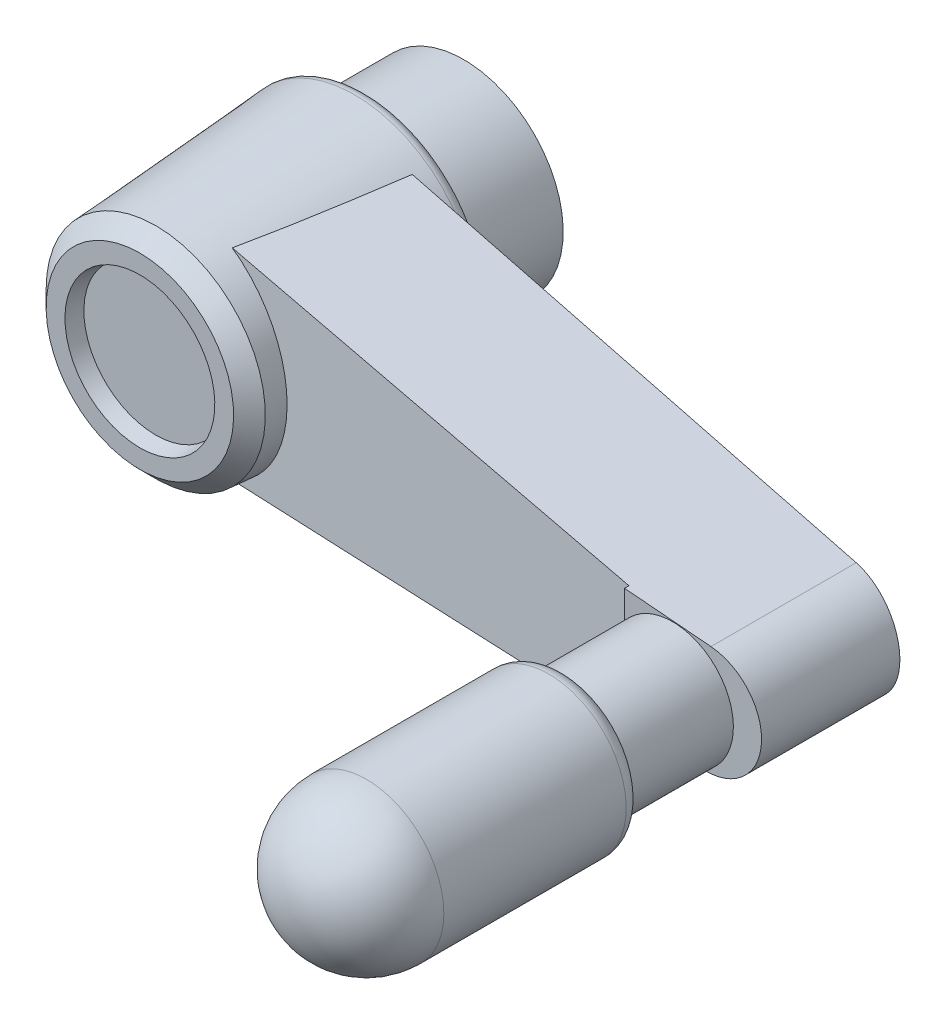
ISO-10303-21;
HEADER;
FILE_DESCRIPTION(('STEP AP214'),'2;1');
FILE_NAME('part.step','',(''),(''),'','','');
FILE_SCHEMA(('AUTOMOTIVE_DESIGN { 1 0 10303 214 1 1 1 1 }'));
ENDSEC;
DATA;
#1=APPLICATION_CONTEXT('core data for automotive mechanical design processes');
#2=APPLICATION_PROTOCOL_DEFINITION('international standard','automotive_design',2000,#1);
#3=PRODUCT_CONTEXT('',#1,'mechanical');
#4=PRODUCT('Part','Part','',(#3));
#5=PRODUCT_RELATED_PRODUCT_CATEGORY('part','',(#4));
#6=PRODUCT_DEFINITION_FORMATION('','',#4);
#7=PRODUCT_DEFINITION_CONTEXT('part definition',#1,'design');
#8=PRODUCT_DEFINITION('design','',#6,#7);
#9=PRODUCT_DEFINITION_SHAPE('','',#8);
#10=(LENGTH_UNIT() NAMED_UNIT(*) SI_UNIT(.MILLI.,.METRE.));
#11=(NAMED_UNIT(*) PLANE_ANGLE_UNIT() SI_UNIT($,.RADIAN.));
#12=(NAMED_UNIT(*) SI_UNIT($,.STERADIAN.) SOLID_ANGLE_UNIT());
#13=UNCERTAINTY_MEASURE_WITH_UNIT(LENGTH_MEASURE(1.E-05),#10,'distance_accuracy_value','');
#14=(GEOMETRIC_REPRESENTATION_CONTEXT(3) GLOBAL_UNCERTAINTY_ASSIGNED_CONTEXT((#13)) GLOBAL_UNIT_ASSIGNED_CONTEXT((#10,
#11,#12)) REPRESENTATION_CONTEXT('',''));
#15=CARTESIAN_POINT('',(0.,0.,0.));
#16=DIRECTION('',(0.,0.,1.));
#17=DIRECTION('',(1.,0.,0.));
#18=AXIS2_PLACEMENT_3D('',#15,#16,#17);
#19=CARTESIAN_POINT('',(45.35,-20.5,31.));
#20=DIRECTION('',(0.,0.,-1.));
#21=DIRECTION('',(0.,1.,0.));
#22=AXIS2_PLACEMENT_3D('',#19,#20,#21);
#23=PLANE('',#22);
#24=CARTESIAN_POINT('',(50.,0.,31.));
#25=DIRECTION('',(0.,0.,-1.));
#26=DIRECTION('',(0.,1.,0.));
#27=AXIS2_PLACEMENT_3D('',#24,#25,#26);
#28=CIRCLE('',#27,4.125);
#29=CARTESIAN_POINT('',(50.,4.125,31.));
#30=VERTEX_POINT('',#29);
#31=EDGE_CURVE('E371',#30,#30,#28,.T.);
#32=ORIENTED_EDGE('',*,*,#31,.T.);
#33=EDGE_LOOP('',(#32));
#34=FACE_BOUND('',#33,.T.);
#35=CARTESIAN_POINT('',(52.75,0.,31.));
#36=DIRECTION('',(0.,0.,1.));
#37=DIRECTION('',(0.,-1.,0.));
#38=AXIS2_PLACEMENT_3D('',#35,#36,#37);
#39=CIRCLE('',#38,5.);
#40=CARTESIAN_POINT('',(53.1699052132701,4.98233676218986,31.));
#41=VERTEX_POINT('',#40);
#42=CARTESIAN_POINT('',(53.1699052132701,-4.98233676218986,31.));
#43=VERTEX_POINT('',#42);
#44=EDGE_CURVE('E472',#41,#43,#39,.F.);
#45=ORIENTED_EDGE('',*,*,#44,.F.);
#46=DIRECTION('',(0.996467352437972,-0.0839810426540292,0.));
#47=VECTOR('',#46,1.);
#48=CARTESIAN_POINT('',(45.35,5.64138875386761,31.));
#49=LINE('',#48,#47);
#50=CARTESIAN_POINT('',(45.35,5.64138875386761,31.));
#51=VERTEX_POINT('',#50);
#52=EDGE_CURVE('E474',#51,#41,#49,.T.);
#53=ORIENTED_EDGE('',*,*,#52,.F.);
#54=DIRECTION('',(0.,1.,0.));
#55=VECTOR('',#54,1.);
#56=CARTESIAN_POINT('',(45.35,-20.5,31.));
#57=LINE('',#56,#55);
#58=CARTESIAN_POINT('',(45.35,-5.64138875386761,31.));
#59=VERTEX_POINT('',#58);
#60=EDGE_CURVE('E471',#59,#51,#57,.T.);
#61=ORIENTED_EDGE('',*,*,#60,.F.);
#62=DIRECTION('',(0.996467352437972,0.0839810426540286,0.));
#63=VECTOR('',#62,1.);
#64=CARTESIAN_POINT('',(0.791941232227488,-9.39668713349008,31.));
#65=LINE('',#64,#63);
#66=EDGE_CURVE('E489',#43,#59,#65,.F.);
#67=ORIENTED_EDGE('',*,*,#66,.F.);
#68=EDGE_LOOP('',(#45,#53,#61,#67));
#69=FACE_BOUND('',#68,.T.);
#70=ADVANCED_FACE('F15',(#34,#69),#23,.F.);
#71=CARTESIAN_POINT('',(52.75,0.,50.));
#72=DIRECTION('',(0.,0.,1.));
#73=DIRECTION('',(0.,-1.,0.));
#74=AXIS2_PLACEMENT_3D('',#71,#72,#73);
#75=CYLINDRICAL_SURFACE('',#74,5.);
#76=CARTESIAN_POINT('',(52.75,0.,17.7978260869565));
#77=DIRECTION('',(-0.136394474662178,0.,0.990654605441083));
#78=DIRECTION('',(0.990654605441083,0.,0.136394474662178));
#79=AXIS2_PLACEMENT_3D('',#76,#77,#78);
#80=ELLIPSE('',#79,5.04716777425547,5.);
#81=CARTESIAN_POINT('',(53.1699052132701,-4.98233676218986,17.8556391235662));
#82=VERTEX_POINT('',#81);
#83=CARTESIAN_POINT('',(53.1699052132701,4.98233676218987,17.8556391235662));
#84=VERTEX_POINT('',#83);
#85=EDGE_CURVE('E455',#82,#84,#80,.T.);
#86=ORIENTED_EDGE('',*,*,#85,.T.);
#87=DIRECTION('',(0.,0.,1.));
#88=VECTOR('',#87,1.);
#89=CARTESIAN_POINT('',(53.1699052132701,4.98233676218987,50.));
#90=LINE('',#89,#88);
#91=EDGE_CURVE('E457',#84,#41,#90,.T.);
#92=ORIENTED_EDGE('',*,*,#91,.T.);
#93=ORIENTED_EDGE('',*,*,#44,.T.);
#94=DIRECTION('',(0.,0.,1.));
#95=VECTOR('',#94,1.);
#96=CARTESIAN_POINT('',(53.1699052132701,-4.98233676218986,50.));
#97=LINE('',#96,#95);
#98=EDGE_CURVE('E460',#82,#43,#97,.T.);
#99=ORIENTED_EDGE('',*,*,#98,.F.);
#100=EDGE_LOOP('',(#86,#92,#93,#99));
#101=FACE_BOUND('',#100,.T.);
#102=ADVANCED_FACE('F444',(#101),#75,.T.);
#103=CARTESIAN_POINT('',(53.1699052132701,4.98233676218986,50.));
#104=DIRECTION('',(0.0839810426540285,0.996467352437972,0.));
#105=DIRECTION('',(-0.996467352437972,0.0839810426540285,0.));
#106=AXIS2_PLACEMENT_3D('',#103,#104,#105);
#107=PLANE('',#106);
#108=ORIENTED_EDGE('',*,*,#91,.F.);
#109=DIRECTION('',(-0.987219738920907,0.0832016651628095,-0.135921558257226));
#110=VECTOR('',#109,1.);
#111=CARTESIAN_POINT('',(53.1699052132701,4.98233676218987,17.8556391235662));
#112=LINE('',#111,#110);
#113=CARTESIAN_POINT('',(6.58727855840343,8.90826323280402,11.4420891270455));
#114=VERTEX_POINT('',#113);
#115=EDGE_CURVE('E468',#84,#114,#112,.T.);
#116=ORIENTED_EDGE('',*,*,#115,.T.);
#117=CARTESIAN_POINT('',(4.38120397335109,9.09418848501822,25.5242199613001));
#118=CARTESIAN_POINT('',(4.49494747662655,9.08460232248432,24.9411251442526));
#119=CARTESIAN_POINT('',(4.60437558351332,9.07537985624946,24.3572049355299));
#120=CARTESIAN_POINT('',(4.8161012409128,9.05753587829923,23.1880902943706));
#121=CARTESIAN_POINT('',(4.91839913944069,9.04891433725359,22.6028959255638));
#122=CARTESIAN_POINT('',(5.11735513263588,9.03214657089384,21.4316720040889));
#123=CARTESIAN_POINT('',(5.21401437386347,9.02400024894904,20.8456426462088));
#124=CARTESIAN_POINT('',(5.40266233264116,9.00810123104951,19.6728210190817));
#125=CARTESIAN_POINT('',(5.49465098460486,9.00034854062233,19.0860287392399));
#126=CARTESIAN_POINT('',(5.76476275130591,8.97758385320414,17.3248298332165));
#127=CARTESIAN_POINT('',(5.93704521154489,8.96306409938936,16.149520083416));
#128=CARTESIAN_POINT('',(6.18685074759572,8.94201079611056,14.3852183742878));
#129=CARTESIAN_POINT('',(6.26869110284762,8.93511339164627,13.7968326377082));
#130=CARTESIAN_POINT('',(6.42981826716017,8.92153379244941,12.6197110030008));
#131=CARTESIAN_POINT('',(6.50910508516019,8.91485159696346,12.0309751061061));
#132=CARTESIAN_POINT('',(6.58727855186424,8.90826323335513,11.4420891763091));
#133=B_SPLINE_CURVE_WITH_KNOTS('',3,(#117,#118,#119,#120,#121,#122,#123,#124,#125,#126,#127,
#128,#129,#130,#131,#132),.UNSPECIFIED.,.F.,.F.,(4,2,2,2,2,2,2,4),(0.,1.78243935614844,
3.56479165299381,5.34678025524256,7.12879387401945,10.6925745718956,12.4748420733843,
14.257103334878),.UNSPECIFIED.);
#134=CARTESIAN_POINT('',(4.38120397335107,9.09418848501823,25.5242199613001));
#135=VERTEX_POINT('',#134);
#136=EDGE_CURVE('E398',#135,#114,#133,.T.);
#137=ORIENTED_EDGE('',*,*,#136,.F.);
#138=DIRECTION('',(0.988959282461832,-0.0833482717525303,0.122525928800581));
#139=VECTOR('',#138,1.);
#140=CARTESIAN_POINT('',(4.38120397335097,9.09418848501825,25.5242199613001));
#141=LINE('',#140,#139);
#142=CARTESIAN_POINT('',(45.35,5.64138875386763,30.6));
#143=VERTEX_POINT('',#142);
#144=EDGE_CURVE('E473',#135,#143,#141,.T.);
#145=ORIENTED_EDGE('',*,*,#144,.T.);
#146=DIRECTION('',(0.,0.,1.));
#147=VECTOR('',#146,1.);
#148=CARTESIAN_POINT('',(45.35,5.64138875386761,30.6));
#149=LINE('',#148,#147);
#150=EDGE_CURVE('E203',#143,#51,#149,.T.);
#151=ORIENTED_EDGE('',*,*,#150,.T.);
#152=ORIENTED_EDGE('',*,*,#52,.T.);
#153=EDGE_LOOP('',(#108,#116,#137,#145,#151,#152));
#154=FACE_BOUND('',#153,.T.);
#155=ADVANCED_FACE('F409',(#154),#107,.T.);
#156=CARTESIAN_POINT('',(45.35,-20.5,30.6));
#157=DIRECTION('',(1.,0.,0.));
#158=DIRECTION('',(0.,1.,0.));
#159=AXIS2_PLACEMENT_3D('',#156,#157,#158);
#160=PLANE('',#159);
#161=ORIENTED_EDGE('',*,*,#60,.T.);
#162=ORIENTED_EDGE('',*,*,#150,.F.);
#163=DIRECTION('',(0.,-1.,0.));
#164=VECTOR('',#163,1.);
#165=CARTESIAN_POINT('',(45.35,-20.5,30.6));
#166=LINE('',#165,#164);
#167=CARTESIAN_POINT('',(45.35,-5.6413887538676,30.6));
#168=VERTEX_POINT('',#167);
#169=EDGE_CURVE('E476',#143,#168,#166,.T.);
#170=ORIENTED_EDGE('',*,*,#169,.T.);
#171=DIRECTION('',(0.,0.,1.));
#172=VECTOR('',#171,1.);
#173=CARTESIAN_POINT('',(45.35,-5.64138875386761,30.6));
#174=LINE('',#173,#172);
#175=EDGE_CURVE('E37',#59,#168,#174,.F.);
#176=ORIENTED_EDGE('',*,*,#175,.F.);
#177=EDGE_LOOP('',(#161,#162,#170,#176));
#178=FACE_BOUND('',#177,.T.);
#179=ADVANCED_FACE('F420',(#178),#160,.F.);
#180=CARTESIAN_POINT('',(0.791941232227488,-9.39668713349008,50.));
#181=DIRECTION('',(0.0839810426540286,-0.996467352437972,0.));
#182=DIRECTION('',(0.996467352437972,0.0839810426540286,0.));
#183=AXIS2_PLACEMENT_3D('',#180,#181,#182);
#184=PLANE('',#183);
#185=ORIENTED_EDGE('',*,*,#175,.T.);
#186=DIRECTION('',(-0.988959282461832,-0.0833482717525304,-0.122525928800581));
#187=VECTOR('',#186,1.);
#188=CARTESIAN_POINT('',(45.35,-5.6413887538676,30.6));
#189=LINE('',#188,#187);
#190=CARTESIAN_POINT('',(4.3812039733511,-9.09418848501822,25.5242199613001));
#191=VERTEX_POINT('',#190);
#192=EDGE_CURVE('E374',#168,#191,#189,.T.);
#193=ORIENTED_EDGE('',*,*,#192,.T.);
#194=CARTESIAN_POINT('',(4.38120397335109,-9.09418848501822,25.5242199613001));
#195=CARTESIAN_POINT('',(4.49494747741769,-9.08460232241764,24.941125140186));
#196=CARTESIAN_POINT('',(4.60437558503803,-9.07537985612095,24.3572049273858));
#197=CARTESIAN_POINT('',(4.81610124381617,-9.05753587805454,23.1880902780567));
#198=CARTESIAN_POINT('',(4.91839914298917,-9.04891433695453,22.6028959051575));
#199=CARTESIAN_POINT('',(5.11735513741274,-9.03214657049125,21.4316719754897));
#200=CARTESIAN_POINT('',(5.21401437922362,-9.02400024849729,20.8456426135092));
#201=CARTESIAN_POINT('',(5.40266233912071,-9.00810123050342,19.6728209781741));
#202=CARTESIAN_POINT('',(5.49465099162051,-9.00034854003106,19.0860286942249));
#203=CARTESIAN_POINT('',(5.76476275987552,-8.97758385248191,17.3248297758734));
#204=CARTESIAN_POINT('',(5.93704522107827,-8.9630640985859,16.149520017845));
#205=CARTESIAN_POINT('',(6.18685075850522,-8.94201079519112,14.3852182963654));
#206=CARTESIAN_POINT('',(6.26869111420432,-8.93511339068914,13.7968325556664));
#207=CARTESIAN_POINT('',(6.42981827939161,-8.92153379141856,12.6197109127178));
#208=CARTESIAN_POINT('',(6.50910509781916,-8.91485159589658,12.0309750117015));
#209=CARTESIAN_POINT('',(6.58727856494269,-8.9082632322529,11.442089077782));
#210=B_SPLINE_CURVE_WITH_KNOTS('',3,(#194,#195,#196,#197,#198,#199,#200,#201,#202,#203,#204,
#205,#206,#207,#208,#209),.UNSPECIFIED.,.F.,.F.,(4,2,2,2,2,2,2,4),(0.,1.78243936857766,
3.56479167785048,5.34678029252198,7.12879392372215,10.6925746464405,12.474842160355,
14.2571034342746),.UNSPECIFIED.);
#211=CARTESIAN_POINT('',(6.58727856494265,-8.9082632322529,11.442089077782));
#212=VERTEX_POINT('',#211);
#213=EDGE_CURVE('E423',#191,#212,#210,.T.);
#214=ORIENTED_EDGE('',*,*,#213,.T.);
#215=DIRECTION('',(0.987219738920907,0.0832016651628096,0.135921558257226));
#216=VECTOR('',#215,1.);
#217=CARTESIAN_POINT('',(6.5872785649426,-8.90826323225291,11.442089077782));
#218=LINE('',#217,#216);
#219=EDGE_CURVE('E432',#212,#82,#218,.T.);
#220=ORIENTED_EDGE('',*,*,#219,.T.);
#221=ORIENTED_EDGE('',*,*,#98,.T.);
#222=ORIENTED_EDGE('',*,*,#66,.T.);
#223=EDGE_LOOP('',(#185,#193,#214,#220,#221,#222));
#224=FACE_BOUND('',#223,.T.);
#225=ADVANCED_FACE('F435',(#224),#184,.T.);
#226=CARTESIAN_POINT('',(50.,0.,23.5335));
#227=DIRECTION('',(0.,0.,-1.));
#228=DIRECTION('',(0.,1.,0.));
#229=AXIS2_PLACEMENT_3D('',#226,#227,#228);
#230=CYLINDRICAL_SURFACE('',#229,2.067);
#231=CARTESIAN_POINT('',(50.,0.,17.4192028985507));
#232=DIRECTION('',(-0.136394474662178,0.,0.990654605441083));
#233=DIRECTION('',(-0.990654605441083,0.,-0.136394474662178));
#234=AXIS2_PLACEMENT_3D('',#231,#232,#233);
#235=ELLIPSE('',#234,2.08649915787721,2.067);
#236=CARTESIAN_POINT('',(47.933,0.,17.134615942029));
#237=VERTEX_POINT('',#236);
#238=EDGE_CURVE('E407',#237,#237,#235,.F.);
#239=ORIENTED_EDGE('',*,*,#238,.T.);
#240=EDGE_LOOP('',(#239));
#241=FACE_BOUND('',#240,.T.);
#242=CARTESIAN_POINT('',(50.,0.,18.0575000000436));
#243=DIRECTION('',(0.,0.,1.));
#244=DIRECTION('',(0.,-1.,0.));
#245=AXIS2_PLACEMENT_3D('',#242,#243,#244);
#246=CIRCLE('',#245,2.067);
#247=CARTESIAN_POINT('',(50.,-2.067,18.0575000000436));
#248=VERTEX_POINT('',#247);
#249=EDGE_CURVE('E9',#248,#248,#246,.T.);
#250=ORIENTED_EDGE('',*,*,#249,.T.);
#251=EDGE_LOOP('',(#250));
#252=FACE_BOUND('',#251,.T.);
#253=ADVANCED_FACE('F439',(#241,#252),#230,.F.);
#254=CARTESIAN_POINT('',(57.85,-20.5,18.5));
#255=DIRECTION('',(-0.136394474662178,0.,0.990654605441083));
#256=DIRECTION('',(-0.990654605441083,0.,-0.136394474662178));
#257=AXIS2_PLACEMENT_3D('',#254,#255,#256);
#258=PLANE('',#257);
#259=CARTESIAN_POINT('',(-0.107286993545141,0.,10.5203735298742));
#260=DIRECTION('',(-0.136394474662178,0.,0.990654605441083));
#261=DIRECTION('',(-0.990654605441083,0.,-0.136394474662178));
#262=AXIS2_PLACEMENT_3D('',#259,#260,#261);
#263=ELLIPSE('',#262,11.2488096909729,11.1431686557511);
#264=EDGE_CURVE('E464',#114,#212,#263,.F.);
#265=ORIENTED_EDGE('',*,*,#264,.F.);
#266=ORIENTED_EDGE('',*,*,#115,.F.);
#267=ORIENTED_EDGE('',*,*,#85,.F.);
#268=ORIENTED_EDGE('',*,*,#219,.F.);
#269=EDGE_LOOP('',(#265,#266,#267,#268));
#270=FACE_BOUND('',#269,.T.);
#271=ORIENTED_EDGE('',*,*,#238,.F.);
#272=EDGE_LOOP('',(#271));
#273=FACE_BOUND('',#272,.T.);
#274=ADVANCED_FACE('F418',(#270,#273),#258,.F.);
#275=CARTESIAN_POINT('',(-11.15,-20.5,23.6));
#276=DIRECTION('',(0.12295374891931,0.,-0.992412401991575));
#277=DIRECTION('',(0.992412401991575,0.,0.12295374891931));
#278=AXIS2_PLACEMENT_3D('',#275,#276,#277);
#279=PLANE('',#278);
#280=CARTESIAN_POINT('',(-0.0877892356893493,0.,24.9705393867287));
#281=DIRECTION('',(0.12295374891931,0.,-0.992412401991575));
#282=DIRECTION('',(-0.992412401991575,0.,-0.12295374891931));
#283=AXIS2_PLACEMENT_3D('',#280,#281,#282);
#284=ELLIPSE('',#283,10.2107058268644,10.1328508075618);
#285=EDGE_CURVE('E433',#191,#135,#284,.F.);
#286=ORIENTED_EDGE('',*,*,#285,.F.);
#287=ORIENTED_EDGE('',*,*,#192,.F.);
#288=ORIENTED_EDGE('',*,*,#169,.F.);
#289=ORIENTED_EDGE('',*,*,#144,.F.);
#290=EDGE_LOOP('',(#286,#287,#288,#289));
#291=FACE_BOUND('',#290,.T.);
#292=ADVANCED_FACE('F416',(#291),#279,.F.);
#293=CARTESIAN_POINT('',(0.,0.,10.0697564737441));
#294=DIRECTION('',(0.,0.,-1.));
#295=DIRECTION('',(0.,1.,0.));
#296=AXIS2_PLACEMENT_3D('',#293,#294,#295);
#297=CONICAL_SURFACE('',#296,11.1751953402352,0.0698131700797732);
#298=CARTESIAN_POINT('',(0.,0.,10.0697564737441));
#299=DIRECTION('',(0.,0.,-1.));
#300=DIRECTION('',(-1.,0.,0.));
#301=AXIS2_PLACEMENT_3D('',#298,#299,#300);
#302=CIRCLE('',#301,11.1751953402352);
#303=CARTESIAN_POINT('',(-11.1751953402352,0.,10.0697564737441));
#304=VERTEX_POINT('',#303);
#305=EDGE_CURVE('E198',#304,#304,#302,.F.);
#306=ORIENTED_EDGE('',*,*,#305,.T.);
#307=EDGE_LOOP('',(#306));
#308=FACE_BOUND('',#307,.T.);
#309=ORIENTED_EDGE('',*,*,#136,.T.);
#310=ORIENTED_EDGE('',*,*,#264,.T.);
#311=ORIENTED_EDGE('',*,*,#213,.F.);
#312=ORIENTED_EDGE('',*,*,#285,.T.);
#313=EDGE_LOOP('',(#309,#310,#311,#312));
#314=FACE_BOUND('',#313,.T.);
#315=CARTESIAN_POINT('',(0.,0.,28.065));
#316=DIRECTION('',(0.,0.,-1.));
#317=DIRECTION('',(-1.,0.,0.));
#318=AXIS2_PLACEMENT_3D('',#315,#316,#317);
#319=CIRCLE('',#318,9.91684533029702);
#320=CARTESIAN_POINT('',(-9.91684533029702,0.,28.065));
#321=VERTEX_POINT('',#320);
#322=EDGE_CURVE('E502',#321,#321,#319,.T.);
#323=ORIENTED_EDGE('',*,*,#322,.T.);
#324=EDGE_LOOP('',(#323));
#325=FACE_BOUND('',#324,.T.);
#326=ADVANCED_FACE('F189',(#308,#314,#325),#297,.T.);
#327=CARTESIAN_POINT('',(0.,0.,10.));
#328=DIRECTION('',(0.,0.,-1.));
#329=DIRECTION('',(0.,1.,0.));
#330=AXIS2_PLACEMENT_3D('',#327,#328,#329);
#331=TOROIDAL_SURFACE('',#330,10.1776312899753,1.);
#332=CARTESIAN_POINT('',(0.,0.,9.));
#333=DIRECTION('',(0.,0.,1.));
#334=DIRECTION('',(-1.,0.,0.));
#335=AXIS2_PLACEMENT_3D('',#332,#333,#334);
#336=CIRCLE('',#335,10.1776312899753);
#337=CARTESIAN_POINT('',(-10.1776312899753,0.,9.));
#338=VERTEX_POINT('',#337);
#339=CARTESIAN_POINT('',(0.,-10.1776312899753,9.));
#340=VERTEX_POINT('',#339);
#341=EDGE_CURVE('E239',#338,#340,#336,.T.);
#342=ORIENTED_EDGE('',*,*,#341,.T.);
#343=CARTESIAN_POINT('',(0.,0.,9.));
#344=DIRECTION('',(0.,0.,1.));
#345=DIRECTION('',(0.,-1.,0.));
#346=AXIS2_PLACEMENT_3D('',#343,#344,#345);
#347=CIRCLE('',#346,10.1776312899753);
#348=CARTESIAN_POINT('',(0.,10.1776312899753,9.));
#349=VERTEX_POINT('',#348);
#350=EDGE_CURVE('E171',#340,#349,#347,.T.);
#351=ORIENTED_EDGE('',*,*,#350,.T.);
#352=CARTESIAN_POINT('',(0.,0.,9.));
#353=DIRECTION('',(0.,0.,1.));
#354=DIRECTION('',(0.,1.,0.));
#355=AXIS2_PLACEMENT_3D('',#352,#353,#354);
#356=CIRCLE('',#355,10.1776312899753);
#357=EDGE_CURVE('E207',#349,#338,#356,.T.);
#358=ORIENTED_EDGE('',*,*,#357,.T.);
#359=EDGE_LOOP('',(#342,#351,#358));
#360=FACE_BOUND('',#359,.T.);
#361=ORIENTED_EDGE('',*,*,#305,.F.);
#362=EDGE_LOOP('',(#361));
#363=FACE_BOUND('',#362,.T.);
#364=ADVANCED_FACE('F177',(#360,#363),#331,.T.);
#365=CARTESIAN_POINT('',(0.,0.,28.065));
#366=DIRECTION('',(0.,0.,-1.));
#367=DIRECTION('',(0.,1.,0.));
#368=AXIS2_PLACEMENT_3D('',#365,#366,#367);
#369=CONICAL_SURFACE('',#368,9.91684533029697,0.785398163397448);
#370=ORIENTED_EDGE('',*,*,#322,.F.);
#371=EDGE_LOOP('',(#370));
#372=FACE_BOUND('',#371,.T.);
#373=CARTESIAN_POINT('',(0.,0.,29.5));
#374=DIRECTION('',(0.,0.,-1.));
#375=DIRECTION('',(0.,1.,0.));
#376=AXIS2_PLACEMENT_3D('',#373,#374,#375);
#377=CIRCLE('',#376,8.48184533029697);
#378=CARTESIAN_POINT('',(0.,8.48184533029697,29.5));
#379=VERTEX_POINT('',#378);
#380=EDGE_CURVE('E204',#379,#379,#377,.T.);
#381=ORIENTED_EDGE('',*,*,#380,.T.);
#382=EDGE_LOOP('',(#381));
#383=FACE_BOUND('',#382,.T.);
#384=ADVANCED_FACE('F188',(#372,#383),#369,.T.);
#385=CARTESIAN_POINT('',(-7.6303905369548,0.,29.5));
#386=DIRECTION('',(0.,0.,1.));
#387=DIRECTION('',(0.,-1.,0.));
#388=AXIS2_PLACEMENT_3D('',#385,#386,#387);
#389=PLANE('',#388);
#390=CARTESIAN_POINT('',(0.,0.,29.4999999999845));
#391=DIRECTION('',(0.,0.,1.));
#392=DIRECTION('',(0.,-1.,0.));
#393=AXIS2_PLACEMENT_3D('',#390,#391,#392);
#394=CIRCLE('',#393,6.77893574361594);
#395=CARTESIAN_POINT('',(0.,-6.77893574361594,29.4999999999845));
#396=VERTEX_POINT('',#395);
#397=EDGE_CURVE('E393',#396,#396,#394,.F.);
#398=ORIENTED_EDGE('',*,*,#397,.T.);
#399=EDGE_LOOP('',(#398));
#400=FACE_BOUND('',#399,.T.);
#401=ORIENTED_EDGE('',*,*,#380,.F.);
#402=EDGE_LOOP('',(#401));
#403=FACE_BOUND('',#402,.T.);
#404=ADVANCED_FACE('F191',(#400,#403),#389,.T.);
#405=CARTESIAN_POINT('',(-9.58881564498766,0.,9.));
#406=DIRECTION('',(0.,0.,-1.));
#407=DIRECTION('',(1.,0.,0.));
#408=AXIS2_PLACEMENT_3D('',#405,#406,#407);
#409=PLANE('',#408);
#410=ORIENTED_EDGE('',*,*,#350,.F.);
#411=ORIENTED_EDGE('',*,*,#341,.F.);
#412=ORIENTED_EDGE('',*,*,#357,.F.);
#413=EDGE_LOOP('',(#410,#411,#412));
#414=FACE_BOUND('',#413,.T.);
#415=CARTESIAN_POINT('',(0.,0.,9.));
#416=DIRECTION('',(0.,0.,1.));
#417=DIRECTION('',(0.,-1.,0.));
#418=AXIS2_PLACEMENT_3D('',#415,#416,#417);
#419=CIRCLE('',#418,9.);
#420=CARTESIAN_POINT('',(0.,-9.,9.));
#421=VERTEX_POINT('',#420);
#422=EDGE_CURVE('E388',#421,#421,#419,.T.);
#423=ORIENTED_EDGE('',*,*,#422,.T.);
#424=EDGE_LOOP('',(#423));
#425=FACE_BOUND('',#424,.T.);
#426=ADVANCED_FACE('F213',(#414,#425),#409,.T.);
#427=CARTESIAN_POINT('',(0.,0.,29.499999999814));
#428=DIRECTION('',(0.,0.,1.));
#429=DIRECTION('',(0.,-1.,0.));
#430=AXIS2_PLACEMENT_3D('',#427,#428,#429);
#431=CONICAL_SURFACE('',#430,6.77893574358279,0.19198621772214);
#432=ORIENTED_EDGE('',*,*,#397,.F.);
#433=EDGE_LOOP('',(#432));
#434=FACE_BOUND('',#433,.T.);
#435=CARTESIAN_POINT('',(0.,0.,28.0650000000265));
#436=DIRECTION('',(0.,0.,1.));
#437=DIRECTION('',(0.,-1.,0.));
#438=AXIS2_PLACEMENT_3D('',#435,#436,#437);
#439=CIRCLE('',#438,6.50000000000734);
#440=CARTESIAN_POINT('',(0.,-6.50000000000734,28.0650000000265));
#441=VERTEX_POINT('',#440);
#442=EDGE_CURVE('E243',#441,#441,#439,.T.);
#443=ORIENTED_EDGE('',*,*,#442,.F.);
#444=EDGE_LOOP('',(#443));
#445=FACE_BOUND('',#444,.T.);
#446=ADVANCED_FACE('F222',(#434,#445),#431,.F.);
#447=CARTESIAN_POINT('',(0.,0.,4.6));
#448=DIRECTION('',(0.,0.,1.));
#449=DIRECTION('',(0.,-1.,0.));
#450=AXIS2_PLACEMENT_3D('',#447,#448,#449);
#451=CYLINDRICAL_SURFACE('',#450,9.);
#452=CARTESIAN_POINT('',(0.,0.,0.2));
#453=DIRECTION('',(0.,0.,1.));
#454=DIRECTION('',(0.,-1.,0.));
#455=AXIS2_PLACEMENT_3D('',#452,#453,#454);
#456=CIRCLE('',#455,9.);
#457=CARTESIAN_POINT('',(0.,-9.,0.2));
#458=VERTEX_POINT('',#457);
#459=EDGE_CURVE('E385',#458,#458,#456,.T.);
#460=ORIENTED_EDGE('',*,*,#459,.T.);
#461=EDGE_LOOP('',(#460));
#462=FACE_BOUND('',#461,.T.);
#463=ORIENTED_EDGE('',*,*,#422,.F.);
#464=EDGE_LOOP('',(#463));
#465=FACE_BOUND('',#464,.T.);
#466=ADVANCED_FACE('F593',(#462,#465),#451,.T.);
#467=CARTESIAN_POINT('',(-3.25,0.,28.065));
#468=DIRECTION('',(0.,0.,1.));
#469=DIRECTION('',(0.,-1.,0.));
#470=AXIS2_PLACEMENT_3D('',#467,#468,#469);
#471=PLANE('',#470);
#472=ORIENTED_EDGE('',*,*,#442,.T.);
#473=EDGE_LOOP('',(#472));
#474=FACE_BOUND('',#473,.T.);
#475=ADVANCED_FACE('F223',(#474),#471,.T.);
#476=CARTESIAN_POINT('',(-8.25,0.,0.2));
#477=DIRECTION('',(0.,0.,-1.));
#478=DIRECTION('',(1.,0.,0.));
#479=AXIS2_PLACEMENT_3D('',#476,#477,#478);
#480=PLANE('',#479);
#481=ORIENTED_EDGE('',*,*,#459,.F.);
#482=EDGE_LOOP('',(#481));
#483=FACE_BOUND('',#482,.T.);
#484=CARTESIAN_POINT('',(0.,0.,0.2));
#485=DIRECTION('',(0.,0.,1.));
#486=DIRECTION('',(0.,-1.,0.));
#487=AXIS2_PLACEMENT_3D('',#484,#485,#486);
#488=CIRCLE('',#487,7.5);
#489=CARTESIAN_POINT('',(0.,-7.5,0.2));
#490=VERTEX_POINT('',#489);
#491=EDGE_CURVE('E382',#490,#490,#488,.T.);
#492=ORIENTED_EDGE('',*,*,#491,.T.);
#493=EDGE_LOOP('',(#492));
#494=FACE_BOUND('',#493,.T.);
#495=ADVANCED_FACE('F608',(#483,#494),#480,.T.);
#496=CARTESIAN_POINT('',(0.,0.,0.1));
#497=DIRECTION('',(0.,0.,1.));
#498=DIRECTION('',(0.,-1.,0.));
#499=AXIS2_PLACEMENT_3D('',#496,#497,#498);
#500=CYLINDRICAL_SURFACE('',#499,7.5);
#501=CARTESIAN_POINT('',(0.,0.,0.));
#502=DIRECTION('',(0.,0.,1.));
#503=DIRECTION('',(0.,-1.,0.));
#504=AXIS2_PLACEMENT_3D('',#501,#502,#503);
#505=CIRCLE('',#504,7.5);
#506=CARTESIAN_POINT('',(0.,-7.5,0.));
#507=VERTEX_POINT('',#506);
#508=EDGE_CURVE('E378',#507,#507,#505,.T.);
#509=ORIENTED_EDGE('',*,*,#508,.T.);
#510=EDGE_LOOP('',(#509));
#511=FACE_BOUND('',#510,.T.);
#512=ORIENTED_EDGE('',*,*,#491,.F.);
#513=EDGE_LOOP('',(#512));
#514=FACE_BOUND('',#513,.T.);
#515=ADVANCED_FACE('F616',(#511,#514),#500,.T.);
#516=CARTESIAN_POINT('',(-3.75,0.,0.));
#517=DIRECTION('',(0.,0.,-1.));
#518=DIRECTION('',(0.,1.,0.));
#519=AXIS2_PLACEMENT_3D('',#516,#517,#518);
#520=PLANE('',#519);
#521=ORIENTED_EDGE('',*,*,#508,.F.);
#522=EDGE_LOOP('',(#521));
#523=FACE_BOUND('',#522,.T.);
#524=CARTESIAN_POINT('',(0.,0.,-5.6843418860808E-11));
#525=DIRECTION('',(0.,0.,-1.));
#526=DIRECTION('',(0.,1.,0.));
#527=AXIS2_PLACEMENT_3D('',#524,#525,#526);
#528=CIRCLE('',#527,3.56250000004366);
#529=CARTESIAN_POINT('',(0.,3.56250000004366,-5.6843418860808E-11));
#530=VERTEX_POINT('',#529);
#531=EDGE_CURVE('E375',#530,#530,#528,.F.);
#532=ORIENTED_EDGE('',*,*,#531,.T.);
#533=EDGE_LOOP('',(#532));
#534=FACE_BOUND('',#533,.T.);
#535=ADVANCED_FACE('F625',(#523,#534),#520,.T.);
#536=CARTESIAN_POINT('',(0.,0.,5.6843418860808E-11));
#537=DIRECTION('',(0.,0.,-1.));
#538=DIRECTION('',(0.,1.,0.));
#539=AXIS2_PLACEMENT_3D('',#536,#537,#538);
#540=CONICAL_SURFACE('',#539,3.56249999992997,0.785398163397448);
#541=ORIENTED_EDGE('',*,*,#531,.F.);
#542=EDGE_LOOP('',(#541));
#543=FACE_BOUND('',#542,.T.);
#544=CARTESIAN_POINT('',(0.,0.,0.562499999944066));
#545=DIRECTION('',(0.,0.,-1.));
#546=DIRECTION('',(1.,0.,0.));
#547=AXIS2_PLACEMENT_3D('',#544,#545,#546);
#548=CIRCLE('',#547,2.99999999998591);
#549=CARTESIAN_POINT('',(2.99999999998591,0.,0.562499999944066));
#550=VERTEX_POINT('',#549);
#551=EDGE_CURVE('E379',#550,#550,#548,.T.);
#552=ORIENTED_EDGE('',*,*,#551,.F.);
#553=EDGE_LOOP('',(#552));
#554=FACE_BOUND('',#553,.T.);
#555=ADVANCED_FACE('F343',(#543,#554),#540,.F.);
#556=CARTESIAN_POINT('',(0.,0.,9.28125));
#557=DIRECTION('',(0.,0.,-1.));
#558=DIRECTION('',(0.,1.,0.));
#559=AXIS2_PLACEMENT_3D('',#556,#557,#558);
#560=CYLINDRICAL_SURFACE('',#559,3.);
#561=ORIENTED_EDGE('',*,*,#551,.T.);
#562=EDGE_LOOP('',(#561));
#563=FACE_BOUND('',#562,.T.);
#564=CARTESIAN_POINT('',(0.,0.,18.));
#565=DIRECTION('',(0.,0.,-1.));
#566=DIRECTION('',(0.,1.,0.));
#567=AXIS2_PLACEMENT_3D('',#564,#565,#566);
#568=CIRCLE('',#567,3.);
#569=CARTESIAN_POINT('',(0.,3.,18.));
#570=VERTEX_POINT('',#569);
#571=EDGE_CURVE('E367',#570,#570,#568,.T.);
#572=ORIENTED_EDGE('',*,*,#571,.F.);
#573=EDGE_LOOP('',(#572));
#574=FACE_BOUND('',#573,.T.);
#575=ADVANCED_FACE('F334',(#563,#574),#560,.F.);
#576=CARTESIAN_POINT('',(0.,0.,18.0000000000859));
#577=DIRECTION('',(0.,0.,-1.));
#578=DIRECTION('',(0.,1.,0.));
#579=AXIS2_PLACEMENT_3D('',#576,#577,#578);
#580=CONICAL_SURFACE('',#579,2.99999999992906,1.04719755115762);
#581=CARTESIAN_POINT('',(2.8421709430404E-11,0.,19.7320508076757));
#582=VERTEX_POINT('',#581);
#583=VERTEX_LOOP('',#582);
#584=FACE_BOUND('',#583,.T.);
#585=ORIENTED_EDGE('',*,*,#571,.T.);
#586=EDGE_LOOP('',(#585));
#587=FACE_BOUND('',#586,.T.);
#588=ADVANCED_FACE('F331',(#584,#587),#580,.F.);
#589=CARTESIAN_POINT('',(50.,0.,18.4904999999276));
#590=DIRECTION('',(0.,0.,1.));
#591=DIRECTION('',(0.,-1.,0.));
#592=AXIS2_PLACEMENT_3D('',#589,#590,#591);
#593=CONICAL_SURFACE('',#592,2.49999999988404,0.785398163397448);
#594=CARTESIAN_POINT('',(50.,0.,18.0000000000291));
#595=DIRECTION('',(0.,0.,1.));
#596=DIRECTION('',(0.,-1.,0.));
#597=AXIS2_PLACEMENT_3D('',#594,#595,#596);
#598=CIRCLE('',#597,2.00949999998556);
#599=CARTESIAN_POINT('',(50.,-2.00949999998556,18.0000000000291));
#600=VERTEX_POINT('',#599);
#601=EDGE_CURVE('E162',#600,#600,#598,.T.);
#602=ORIENTED_EDGE('',*,*,#601,.T.);
#603=EDGE_LOOP('',(#602));
#604=FACE_BOUND('',#603,.T.);
#605=ORIENTED_EDGE('',*,*,#249,.F.);
#606=EDGE_LOOP('',(#605));
#607=FACE_BOUND('',#606,.T.);
#608=ADVANCED_FACE('F333',(#604,#607),#593,.T.);
#609=CARTESIAN_POINT('',(50.,1.00475,18.));
#610=DIRECTION('',(0.,0.,-1.));
#611=DIRECTION('',(0.,1.,0.));
#612=AXIS2_PLACEMENT_3D('',#609,#610,#611);
#613=PLANE('',#612);
#614=ORIENTED_EDGE('',*,*,#601,.F.);
#615=EDGE_LOOP('',(#614));
#616=FACE_BOUND('',#615,.T.);
#617=DIRECTION('',(0.,1.,0.));
#618=VECTOR('',#617,1.);
#619=CARTESIAN_POINT('',(51.25,0.721687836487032,18.));
#620=LINE('',#619,#618);
#621=CARTESIAN_POINT('',(51.25,-0.721687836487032,18.));
#622=VERTEX_POINT('',#621);
#623=CARTESIAN_POINT('',(51.25,0.721687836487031,18.));
#624=VERTEX_POINT('',#623);
#625=EDGE_CURVE('E293',#622,#624,#620,.T.);
#626=ORIENTED_EDGE('',*,*,#625,.T.);
#627=DIRECTION('',(-0.86602540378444,0.5,0.));
#628=VECTOR('',#627,1.);
#629=CARTESIAN_POINT('',(51.25,0.721687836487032,18.));
#630=LINE('',#629,#628);
#631=CARTESIAN_POINT('',(50.,1.44337567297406,18.));
#632=VERTEX_POINT('',#631);
#633=EDGE_CURVE('E165',#624,#632,#630,.T.);
#634=ORIENTED_EDGE('',*,*,#633,.T.);
#635=DIRECTION('',(-0.866025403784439,-0.5,0.));
#636=VECTOR('',#635,1.);
#637=CARTESIAN_POINT('',(48.75,0.721687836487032,18.));
#638=LINE('',#637,#636);
#639=CARTESIAN_POINT('',(48.75,0.721687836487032,18.));
#640=VERTEX_POINT('',#639);
#641=EDGE_CURVE('E291',#632,#640,#638,.T.);
#642=ORIENTED_EDGE('',*,*,#641,.T.);
#643=DIRECTION('',(0.,-1.,0.));
#644=VECTOR('',#643,1.);
#645=CARTESIAN_POINT('',(48.75,-0.721687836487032,18.));
#646=LINE('',#645,#644);
#647=CARTESIAN_POINT('',(48.75,-0.721687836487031,18.));
#648=VERTEX_POINT('',#647);
#649=EDGE_CURVE('E134',#640,#648,#646,.T.);
#650=ORIENTED_EDGE('',*,*,#649,.T.);
#651=DIRECTION('',(0.866025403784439,-0.5,0.));
#652=VECTOR('',#651,1.);
#653=CARTESIAN_POINT('',(50.,-1.44337567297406,18.));
#654=LINE('',#653,#652);
#655=CARTESIAN_POINT('',(50.,-1.44337567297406,18.));
#656=VERTEX_POINT('',#655);
#657=EDGE_CURVE('E128',#648,#656,#654,.T.);
#658=ORIENTED_EDGE('',*,*,#657,.T.);
#659=DIRECTION('',(0.866025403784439,0.5,0.));
#660=VECTOR('',#659,1.);
#661=CARTESIAN_POINT('',(51.25,-0.721687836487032,18.));
#662=LINE('',#661,#660);
#663=EDGE_CURVE('E131',#656,#622,#662,.T.);
#664=ORIENTED_EDGE('',*,*,#663,.T.);
#665=EDGE_LOOP('',(#626,#634,#642,#650,#658,#664));
#666=FACE_BOUND('',#665,.T.);
#667=ADVANCED_FACE('F129',(#616,#666),#613,.T.);
#668=CARTESIAN_POINT('',(51.25,0.721687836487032,18.));
#669=DIRECTION('',(1.,0.,0.));
#670=DIRECTION('',(0.,1.,0.));
#671=AXIS2_PLACEMENT_3D('',#668,#669,#670);
#672=PLANE('',#671);
#673=DIRECTION('',(0.,0.,1.));
#674=VECTOR('',#673,1.);
#675=CARTESIAN_POINT('',(51.25,0.721687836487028,18.));
#676=LINE('',#675,#674);
#677=CARTESIAN_POINT('',(51.25,0.721687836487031,20.5));
#678=VERTEX_POINT('',#677);
#679=EDGE_CURVE('E280',#678,#624,#676,.F.);
#680=ORIENTED_EDGE('',*,*,#679,.T.);
#681=ORIENTED_EDGE('',*,*,#625,.F.);
#682=DIRECTION('',(0.,0.,1.));
#683=VECTOR('',#682,1.);
#684=CARTESIAN_POINT('',(51.25,-0.721687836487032,18.));
#685=LINE('',#684,#683);
#686=CARTESIAN_POINT('',(51.25,-0.721687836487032,20.5));
#687=VERTEX_POINT('',#686);
#688=EDGE_CURVE('E143',#687,#622,#685,.F.);
#689=ORIENTED_EDGE('',*,*,#688,.F.);
#690=DIRECTION('',(0.,-1.,0.));
#691=VECTOR('',#690,1.);
#692=CARTESIAN_POINT('',(51.25,0.,20.5));
#693=LINE('',#692,#691);
#694=EDGE_CURVE('E286',#687,#678,#693,.F.);
#695=ORIENTED_EDGE('',*,*,#694,.T.);
#696=EDGE_LOOP('',(#680,#681,#689,#695));
#697=FACE_BOUND('',#696,.T.);
#698=ADVANCED_FACE('F309',(#697),#672,.F.);
#699=CARTESIAN_POINT('',(50.,1.44337567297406,18.));
#700=DIRECTION('',(0.5,0.866025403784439,0.));
#701=DIRECTION('',(-0.866025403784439,0.5,0.));
#702=AXIS2_PLACEMENT_3D('',#699,#700,#701);
#703=PLANE('',#702);
#704=DIRECTION('',(0.,0.,1.));
#705=VECTOR('',#704,1.);
#706=CARTESIAN_POINT('',(50.,1.44337567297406,18.));
#707=LINE('',#706,#705);
#708=CARTESIAN_POINT('',(50.,1.44337567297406,20.5));
#709=VERTEX_POINT('',#708);
#710=EDGE_CURVE('E278',#632,#709,#707,.T.);
#711=ORIENTED_EDGE('',*,*,#710,.F.);
#712=ORIENTED_EDGE('',*,*,#633,.F.);
#713=ORIENTED_EDGE('',*,*,#679,.F.);
#714=DIRECTION('',(-0.866025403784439,0.5,0.));
#715=VECTOR('',#714,1.);
#716=CARTESIAN_POINT('',(50.,1.44337567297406,20.5));
#717=LINE('',#716,#715);
#718=EDGE_CURVE('E275',#709,#678,#717,.F.);
#719=ORIENTED_EDGE('',*,*,#718,.F.);
#720=EDGE_LOOP('',(#711,#712,#713,#719));
#721=FACE_BOUND('',#720,.T.);
#722=ADVANCED_FACE('F314',(#721),#703,.F.);
#723=CARTESIAN_POINT('',(48.75,0.721687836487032,18.));
#724=DIRECTION('',(-0.5,0.866025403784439,0.));
#725=DIRECTION('',(-0.866025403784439,-0.5,0.));
#726=AXIS2_PLACEMENT_3D('',#723,#724,#725);
#727=PLANE('',#726);
#728=DIRECTION('',(0.,0.,1.));
#729=VECTOR('',#728,1.);
#730=CARTESIAN_POINT('',(48.75,0.721687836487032,18.));
#731=LINE('',#730,#729);
#732=CARTESIAN_POINT('',(48.75,0.721687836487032,20.5));
#733=VERTEX_POINT('',#732);
#734=EDGE_CURVE('E288',#640,#733,#731,.T.);
#735=ORIENTED_EDGE('',*,*,#734,.F.);
#736=ORIENTED_EDGE('',*,*,#641,.F.);
#737=ORIENTED_EDGE('',*,*,#710,.T.);
#738=DIRECTION('',(-0.86602540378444,-0.5,0.));
#739=VECTOR('',#738,1.);
#740=CARTESIAN_POINT('',(50.,1.44337567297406,20.5));
#741=LINE('',#740,#739);
#742=EDGE_CURVE('E283',#709,#733,#741,.T.);
#743=ORIENTED_EDGE('',*,*,#742,.T.);
#744=EDGE_LOOP('',(#735,#736,#737,#743));
#745=FACE_BOUND('',#744,.T.);
#746=ADVANCED_FACE('F316',(#745),#727,.F.);
#747=CARTESIAN_POINT('',(48.75,-0.721687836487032,18.));
#748=DIRECTION('',(-1.,0.,0.));
#749=DIRECTION('',(0.,-1.,0.));
#750=AXIS2_PLACEMENT_3D('',#747,#748,#749);
#751=PLANE('',#750);
#752=DIRECTION('',(0.,0.,1.));
#753=VECTOR('',#752,1.);
#754=CARTESIAN_POINT('',(48.75,-0.721687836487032,18.));
#755=LINE('',#754,#753);
#756=CARTESIAN_POINT('',(48.75,-0.72168783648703,20.5));
#757=VERTEX_POINT('',#756);
#758=EDGE_CURVE('E298',#648,#757,#755,.T.);
#759=ORIENTED_EDGE('',*,*,#758,.F.);
#760=ORIENTED_EDGE('',*,*,#649,.F.);
#761=ORIENTED_EDGE('',*,*,#734,.T.);
#762=DIRECTION('',(0.,-1.,0.));
#763=VECTOR('',#762,1.);
#764=CARTESIAN_POINT('',(48.75,-0.721687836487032,20.5));
#765=LINE('',#764,#763);
#766=EDGE_CURVE('E296',#757,#733,#765,.F.);
#767=ORIENTED_EDGE('',*,*,#766,.F.);
#768=EDGE_LOOP('',(#759,#760,#761,#767));
#769=FACE_BOUND('',#768,.T.);
#770=ADVANCED_FACE('F301',(#769),#751,.F.);
#771=CARTESIAN_POINT('',(50.,-1.44337567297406,18.));
#772=DIRECTION('',(-0.5,-0.866025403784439,0.));
#773=DIRECTION('',(0.866025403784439,-0.5,0.));
#774=AXIS2_PLACEMENT_3D('',#771,#772,#773);
#775=PLANE('',#774);
#776=DIRECTION('',(0.,0.,1.));
#777=VECTOR('',#776,1.);
#778=CARTESIAN_POINT('',(50.,-1.44337567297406,18.));
#779=LINE('',#778,#777);
#780=CARTESIAN_POINT('',(50.,-1.44337567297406,20.5));
#781=VERTEX_POINT('',#780);
#782=EDGE_CURVE('E138',#781,#656,#779,.F.);
#783=ORIENTED_EDGE('',*,*,#782,.T.);
#784=ORIENTED_EDGE('',*,*,#657,.F.);
#785=ORIENTED_EDGE('',*,*,#758,.T.);
#786=DIRECTION('',(0.866025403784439,-0.5,0.));
#787=VECTOR('',#786,1.);
#788=CARTESIAN_POINT('',(50.,-1.44337567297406,20.5));
#789=LINE('',#788,#787);
#790=EDGE_CURVE('E123',#781,#757,#789,.F.);
#791=ORIENTED_EDGE('',*,*,#790,.F.);
#792=EDGE_LOOP('',(#783,#784,#785,#791));
#793=FACE_BOUND('',#792,.T.);
#794=ADVANCED_FACE('F17',(#793),#775,.F.);
#795=CARTESIAN_POINT('',(51.25,-0.721687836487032,18.));
#796=DIRECTION('',(0.5,-0.866025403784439,0.));
#797=DIRECTION('',(0.866025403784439,0.5,0.));
#798=AXIS2_PLACEMENT_3D('',#795,#796,#797);
#799=PLANE('',#798);
#800=ORIENTED_EDGE('',*,*,#688,.T.);
#801=ORIENTED_EDGE('',*,*,#663,.F.);
#802=ORIENTED_EDGE('',*,*,#782,.F.);
#803=DIRECTION('',(0.866025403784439,0.5,0.));
#804=VECTOR('',#803,1.);
#805=CARTESIAN_POINT('',(51.25,-0.721687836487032,20.5));
#806=LINE('',#805,#804);
#807=EDGE_CURVE('E145',#687,#781,#806,.F.);
#808=ORIENTED_EDGE('',*,*,#807,.F.);
#809=EDGE_LOOP('',(#800,#801,#802,#808));
#810=FACE_BOUND('',#809,.T.);
#811=ADVANCED_FACE('F141',(#810),#799,.F.);
#812=CARTESIAN_POINT('',(50.,0.,20.5));
#813=DIRECTION('',(0.,0.,1.));
#814=DIRECTION('',(0.,-1.,0.));
#815=AXIS2_PLACEMENT_3D('',#812,#813,#814);
#816=PLANE('',#815);
#817=ORIENTED_EDGE('',*,*,#718,.T.);
#818=ORIENTED_EDGE('',*,*,#694,.F.);
#819=ORIENTED_EDGE('',*,*,#807,.T.);
#820=ORIENTED_EDGE('',*,*,#790,.T.);
#821=ORIENTED_EDGE('',*,*,#766,.T.);
#822=ORIENTED_EDGE('',*,*,#742,.F.);
#823=EDGE_LOOP('',(#817,#818,#819,#820,#821,#822));
#824=FACE_BOUND('',#823,.T.);
#825=ADVANCED_FACE('F305',(#824),#816,.F.);
#826=CARTESIAN_POINT('',(50.,0.,31.15));
#827=DIRECTION('',(0.,0.,1.));
#828=DIRECTION('',(0.,-1.,0.));
#829=AXIS2_PLACEMENT_3D('',#826,#827,#828);
#830=CYLINDRICAL_SURFACE('',#829,4.125);
#831=ORIENTED_EDGE('',*,*,#31,.F.);
#832=EDGE_LOOP('',(#831));
#833=FACE_BOUND('',#832,.T.);
#834=CARTESIAN_POINT('',(50.,0.,31.3));
#835=DIRECTION('',(0.,0.,1.));
#836=DIRECTION('',(0.,-1.,0.));
#837=AXIS2_PLACEMENT_3D('',#834,#835,#836);
#838=CIRCLE('',#837,4.125);
#839=CARTESIAN_POINT('',(50.,-4.125,31.3));
#840=VERTEX_POINT('',#839);
#841=EDGE_CURVE('E155',#840,#840,#838,.T.);
#842=ORIENTED_EDGE('',*,*,#841,.F.);
#843=EDGE_LOOP('',(#842));
#844=FACE_BOUND('',#843,.T.);
#845=ADVANCED_FACE('F329',(#833,#844),#830,.T.);
#846=CARTESIAN_POINT('',(50.,4.8125,31.3));
#847=DIRECTION('',(0.,0.,-1.));
#848=DIRECTION('',(0.,1.,0.));
#849=AXIS2_PLACEMENT_3D('',#846,#847,#848);
#850=PLANE('',#849);
#851=CARTESIAN_POINT('',(50.,0.,31.3));
#852=DIRECTION('',(0.,0.,1.));
#853=DIRECTION('',(0.,-1.,0.));
#854=AXIS2_PLACEMENT_3D('',#851,#852,#853);
#855=CIRCLE('',#854,5.5);
#856=CARTESIAN_POINT('',(50.,-5.5,31.3));
#857=VERTEX_POINT('',#856);
#858=EDGE_CURVE('E151',#857,#857,#855,.T.);
#859=ORIENTED_EDGE('',*,*,#858,.F.);
#860=EDGE_LOOP('',(#859));
#861=FACE_BOUND('',#860,.T.);
#862=ORIENTED_EDGE('',*,*,#841,.T.);
#863=EDGE_LOOP('',(#862));
#864=FACE_BOUND('',#863,.T.);
#865=ADVANCED_FACE('F722',(#861,#864),#850,.T.);
#866=CARTESIAN_POINT('',(50.,0.,36.15));
#867=DIRECTION('',(0.,0.,1.));
#868=DIRECTION('',(0.,-1.,0.));
#869=AXIS2_PLACEMENT_3D('',#866,#867,#868);
#870=CYLINDRICAL_SURFACE('',#869,5.5);
#871=CARTESIAN_POINT('',(50.,0.,41.));
#872=DIRECTION('',(0.,0.,-1.));
#873=DIRECTION('',(-1.,0.,0.));
#874=AXIS2_PLACEMENT_3D('',#871,#872,#873);
#875=CIRCLE('',#874,5.5);
#876=CARTESIAN_POINT('',(44.5,0.,41.));
#877=VERTEX_POINT('',#876);
#878=EDGE_CURVE('E154',#877,#877,#875,.F.);
#879=ORIENTED_EDGE('',*,*,#878,.F.);
#880=EDGE_LOOP('',(#879));
#881=FACE_BOUND('',#880,.T.);
#882=ORIENTED_EDGE('',*,*,#858,.T.);
#883=EDGE_LOOP('',(#882));
#884=FACE_BOUND('',#883,.T.);
#885=ADVANCED_FACE('F732',(#881,#884),#870,.T.);
#886=CARTESIAN_POINT('',(50.,0.,42.5));
#887=DIRECTION('',(0.,0.,-1.));
#888=DIRECTION('',(-1.,0.,0.));
#889=AXIS2_PLACEMENT_3D('',#886,#887,#888);
#890=TOROIDAL_SURFACE('',#889,5.50000000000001,1.5);
#891=ORIENTED_EDGE('',*,*,#878,.T.);
#892=EDGE_LOOP('',(#891));
#893=FACE_BOUND('',#892,.T.);
#894=CARTESIAN_POINT('',(50.,0.,42.5));
#895=DIRECTION('',(0.,0.,1.));
#896=DIRECTION('',(0.,-1.,0.));
#897=AXIS2_PLACEMENT_3D('',#894,#895,#896);
#898=CIRCLE('',#897,7.);
#899=CARTESIAN_POINT('',(50.,-7.,42.5));
#900=VERTEX_POINT('',#899);
#901=EDGE_CURVE('E261',#900,#900,#898,.T.);
#902=ORIENTED_EDGE('',*,*,#901,.F.);
#903=EDGE_LOOP('',(#902));
#904=FACE_BOUND('',#903,.T.);
#905=ADVANCED_FACE('F742',(#893,#904),#890,.T.);
#906=CARTESIAN_POINT('',(50.,0.,50.75));
#907=DIRECTION('',(0.,0.,1.));
#908=DIRECTION('',(0.,-1.,0.));
#909=AXIS2_PLACEMENT_3D('',#906,#907,#908);
#910=CYLINDRICAL_SURFACE('',#909,7.);
#911=ORIENTED_EDGE('',*,*,#901,.T.);
#912=EDGE_LOOP('',(#911));
#913=FACE_BOUND('',#912,.T.);
#914=CARTESIAN_POINT('',(50.,0.,59.));
#915=DIRECTION('',(0.,0.,1.));
#916=DIRECTION('',(0.,-1.,0.));
#917=AXIS2_PLACEMENT_3D('',#914,#915,#916);
#918=CIRCLE('',#917,7.);
#919=CARTESIAN_POINT('',(57.,-4.966031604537E-12,59.));
#920=VERTEX_POINT('',#919);
#921=EDGE_CURVE('E259',#920,#920,#918,.F.);
#922=ORIENTED_EDGE('',*,*,#921,.T.);
#923=EDGE_LOOP('',(#922));
#924=FACE_BOUND('',#923,.T.);
#925=ADVANCED_FACE('F352',(#913,#924),#910,.T.);
#926=CARTESIAN_POINT('',(50.,0.,59.));
#927=DIRECTION('',(0.,0.,1.));
#928=DIRECTION('',(0.,1.,0.));
#929=AXIS2_PLACEMENT_3D('',#926,#927,#928);
#930=SPHERICAL_SURFACE('',#929,7.);
#931=ORIENTED_EDGE('',*,*,#921,.F.);
#932=CARTESIAN_POINT('',(50.,0.,66.));
#933=CARTESIAN_POINT('',(50.1145373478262,-1.62584941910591E-13,66.0000024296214));
#934=CARTESIAN_POINT('',(50.2290744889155,-3.2516959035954E-13,65.9971889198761));
#935=CARTESIAN_POINT('',(50.4578729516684,-6.4994736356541E-13,65.9859474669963));
#936=CARTESIAN_POINT('',(50.572134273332,-8.12140488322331E-13,65.977519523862));
#937=CARTESIAN_POINT('',(50.8001056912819,-1.13574427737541E-12,65.9550666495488));
#938=CARTESIAN_POINT('',(50.9138157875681,-1.29715494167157E-12,65.94104171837));
#939=CARTESIAN_POINT('',(51.1404108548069,-1.61880501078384E-12,65.907429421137));
#940=CARTESIAN_POINT('',(51.2532958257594,-1.77904441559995E-12,65.8878420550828));
#941=CARTESIAN_POINT('',(51.4779686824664,-2.09796592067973E-12,65.8431518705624));
#942=CARTESIAN_POINT('',(51.5897565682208,-2.25664802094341E-12,65.8180490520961));
#943=CARTESIAN_POINT('',(51.8119659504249,-2.57207264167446E-12,65.7623884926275));
#944=CARTESIAN_POINT('',(51.9223874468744,-2.72881516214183E-12,65.7318307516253));
#945=CARTESIAN_POINT('',(52.1415980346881,-3.03998301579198E-12,65.6653339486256));
#946=CARTESIAN_POINT('',(52.2503871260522,-3.19440834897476E-12,65.6293948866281));
#947=CARTESIAN_POINT('',(52.4660708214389,-3.50056980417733E-12,65.5522220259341));
#948=CARTESIAN_POINT('',(52.5729654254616,-3.65230592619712E-12,65.5109882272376));
#949=CARTESIAN_POINT('',(52.7846026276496,-3.95272341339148E-12,65.4233252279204));
#950=CARTESIAN_POINT('',(52.889345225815,-4.10140477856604E-12,65.3768960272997));
#951=CARTESIAN_POINT('',(53.0964260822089,-4.39535456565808E-12,65.2789540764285));
#952=CARTESIAN_POINT('',(53.1987643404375,-4.54062298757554E-12,65.2274413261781));
#953=CARTESIAN_POINT('',(53.4007899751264,-4.82739692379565E-12,65.1194563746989));
#954=CARTESIAN_POINT('',(53.5004773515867,-4.96890243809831E-12,65.0629841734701));
#955=CARTESIAN_POINT('',(53.6969610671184,-5.24780965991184E-12,64.9452163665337));
#956=CARTESIAN_POINT('',(53.7937574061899,-5.38521136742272E-12,64.8839207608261));
#957=CARTESIAN_POINT('',(53.9842258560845,-5.65557996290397E-12,64.7566538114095));
#958=CARTESIAN_POINT('',(54.0778979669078,-5.78854685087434E-12,64.6906824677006));
#959=CARTESIAN_POINT('',(54.2618922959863,-6.04972547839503E-12,64.5542229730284));
#960=CARTESIAN_POINT('',(54.3522145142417,-6.17793721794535E-12,64.4837348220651));
#961=CARTESIAN_POINT('',(54.5292914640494,-6.42929667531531E-12,64.3384115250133));
#962=CARTESIAN_POINT('',(54.6160461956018,-6.55244439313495E-12,64.2635763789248));
#963=CARTESIAN_POINT('',(54.7857791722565,-6.79337913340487E-12,64.1097393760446));
#964=CARTESIAN_POINT('',(54.8687574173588,-6.91116615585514E-12,64.0307375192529));
#965=CARTESIAN_POINT('',(55.0307375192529,-7.14109574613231E-12,63.8687574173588));
#966=CARTESIAN_POINT('',(55.1097393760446,-7.2532383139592E-12,63.7857791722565));
#967=CARTESIAN_POINT('',(55.2635763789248,-7.47160883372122E-12,63.6160461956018));
#968=CARTESIAN_POINT('',(55.3384115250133,-7.57783678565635E-12,63.5292914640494));
#969=CARTESIAN_POINT('',(55.4837348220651,-7.784122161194E-12,63.3522145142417));
#970=CARTESIAN_POINT('',(55.5542229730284,-7.88417958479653E-12,63.2618922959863));
#971=CARTESIAN_POINT('',(55.6906824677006,-8.07788285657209E-12,63.0778979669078));
#972=CARTESIAN_POINT('',(55.7566538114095,-8.17152870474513E-12,62.9842258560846));
#973=CARTESIAN_POINT('',(55.8839207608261,-8.35218322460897E-12,62.7937574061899));
#974=CARTESIAN_POINT('',(55.9452163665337,-8.43919189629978E-12,62.6969610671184));
#975=CARTESIAN_POINT('',(56.0629841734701,-8.60636245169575E-12,62.5004773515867));
#976=CARTESIAN_POINT('',(56.1194563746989,-8.68652433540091E-12,62.4007899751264));
#977=CARTESIAN_POINT('',(56.2274413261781,-8.8398081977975E-12,62.1987643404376));
#978=CARTESIAN_POINT('',(56.2789540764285,-8.91293017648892E-12,62.096426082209));
#979=CARTESIAN_POINT('',(56.3768960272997,-9.05195807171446E-12,61.889345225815));
#980=CARTESIAN_POINT('',(56.4233252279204,-9.11786398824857E-12,61.7846026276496));
#981=CARTESIAN_POINT('',(56.5109882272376,-9.24230098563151E-12,61.5729654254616));
#982=CARTESIAN_POINT('',(56.5522220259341,-9.30083206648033E-12,61.4660708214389));
#983=CARTESIAN_POINT('',(56.6293948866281,-9.41037838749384E-12,61.2503871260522));
#984=CARTESIAN_POINT('',(56.6653339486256,-9.46139362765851E-12,61.1415980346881));
#985=CARTESIAN_POINT('',(56.7318307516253,-9.55578536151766E-12,60.9223874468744));
#986=CARTESIAN_POINT('',(56.7623884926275,-9.59916185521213E-12,60.8119659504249));
#987=CARTESIAN_POINT('',(56.8180490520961,-9.67817161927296E-12,60.5897565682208));
#988=CARTESIAN_POINT('',(56.8431518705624,-9.71380488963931E-12,60.4779686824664));
#989=CARTESIAN_POINT('',(56.8878420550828,-9.77724228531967E-12,60.2532958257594));
#990=CARTESIAN_POINT('',(56.907429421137,-9.80504641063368E-12,60.1404108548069));
#991=CARTESIAN_POINT('',(56.94104171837,-9.85275882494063E-12,59.9138157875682));
#992=CARTESIAN_POINT('',(56.9550666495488,-9.87266711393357E-12,59.8001056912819));
#993=CARTESIAN_POINT('',(56.977519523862,-9.90453880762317E-12,59.572134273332));
#994=CARTESIAN_POINT('',(56.9859474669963,-9.91650221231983E-12,59.4578729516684));
#995=CARTESIAN_POINT('',(56.9971889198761,-9.93245937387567E-12,59.2290744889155));
#996=CARTESIAN_POINT('',(57.0000024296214,-9.93645313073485E-12,59.1145373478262));
#997=CARTESIAN_POINT('',(57.,-9.9364496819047E-12,59.));
#998=B_SPLINE_CURVE_WITH_KNOTS('',3,(#932,#933,#934,#935,#936,#937,#938,#939,#940,#941,#942,
#943,#944,#945,#946,#947,#948,#949,#950,#951,#952,#953,#954,#955,#956,#957,#958,#959,#960,#961,
#962,#963,#964,#965,#966,#967,#968,#969,#970,#971,#972,#973,#974,#975,#976,#977,#978,#979,#980,
#981,#982,#983,#984,#985,#986,#987,#988,#989,#990,#991,#992,#993,#994,#995,#996,#997),
.UNSPECIFIED.,.F.,.F.,(4,2,2,2,2,2,2,2,2,2,2,2,2,2,2,2,2,2,2,2,2,2,2,2,2,2,2,2,2,2,2,2,4),(0.,
0.343577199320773,0.687154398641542,1.03073159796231,1.37430879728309,1.71788599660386,
2.06146319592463,2.4050403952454,2.74861759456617,3.09219479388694,3.43577199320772,
3.77934919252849,4.12292639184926,4.46650359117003,4.81008079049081,5.15365798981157,
5.49723518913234,5.84081238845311,6.18438958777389,6.52796678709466,6.87154398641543,
7.2151211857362,7.55869838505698,7.90227558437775,8.24585278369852,8.58942998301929,
8.93300718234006,9.27658438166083,9.62016158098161,9.96373878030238,10.3073159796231,
10.6508931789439,10.9944703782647),.UNSPECIFIED.);
#999=CARTESIAN_POINT('',(50.,0.,66.));
#1000=VERTEX_POINT('',#999);
#1001=EDGE_CURVE('E257',#1000,#920,#998,.T.);
#1002=ORIENTED_EDGE('',*,*,#1001,.F.);
#1003=ORIENTED_EDGE('',*,*,#1001,.T.);
#1004=EDGE_LOOP('',(#931,#1002,#1003));
#1005=FACE_BOUND('',#1004,.T.);
#1006=ADVANCED_FACE('F258',(#1005),#930,.T.);
#1007=CLOSED_SHELL('',(#70,#102,#155,#179,#225,#253,#274,#292,#326,#364,#384,#404,#426,#446,
#466,#475,#495,#515,#535,#555,#575,#588,#608,#667,#698,#722,#746,#770,#794,#811,#825,#845,#865,
#885,#905,#925,#1006));
#1008=CARTESIAN_POINT('',(50.,0.,30.35));
#1009=DIRECTION('',(0.,0.,1.));
#1010=DIRECTION('',(0.,-1.,0.));
#1011=AXIS2_PLACEMENT_3D('',#1008,#1009,#1010);
#1012=CYLINDRICAL_SURFACE('',#1011,2.0095);
#1013=CARTESIAN_POINT('',(50.,0.,29.7));
#1014=DIRECTION('',(0.,0.,1.));
#1015=DIRECTION('',(0.,-1.,0.));
#1016=AXIS2_PLACEMENT_3D('',#1013,#1014,#1015);
#1017=CIRCLE('',#1016,2.0095);
#1018=CARTESIAN_POINT('',(50.,-2.0095,29.7));
#1019=VERTEX_POINT('',#1018);
#1020=EDGE_CURVE('E161',#1019,#1019,#1017,.T.);
#1021=ORIENTED_EDGE('',*,*,#1020,.T.);
#1022=EDGE_LOOP('',(#1021));
#1023=FACE_BOUND('',#1022,.T.);
#1024=CARTESIAN_POINT('',(50.,0.,31.));
#1025=DIRECTION('',(0.,0.,1.));
#1026=DIRECTION('',(0.,-1.,0.));
#1027=AXIS2_PLACEMENT_3D('',#1024,#1025,#1026);
#1028=CIRCLE('',#1027,2.0095);
#1029=CARTESIAN_POINT('',(50.,-2.0095,31.));
#1030=VERTEX_POINT('',#1029);
#1031=EDGE_CURVE('E158',#1030,#1030,#1028,.T.);
#1032=ORIENTED_EDGE('',*,*,#1031,.F.);
#1033=EDGE_LOOP('',(#1032));
#1034=FACE_BOUND('',#1033,.T.);
#1035=ADVANCED_FACE('F769',(#1023,#1034),#1012,.T.);
#1036=CARTESIAN_POINT('',(50.,3.06725,31.));
#1037=DIRECTION('',(0.,0.,-1.));
#1038=DIRECTION('',(0.,1.,0.));
#1039=AXIS2_PLACEMENT_3D('',#1036,#1037,#1038);
#1040=PLANE('',#1039);
#1041=ORIENTED_EDGE('',*,*,#1031,.T.);
#1042=EDGE_LOOP('',(#1041));
#1043=FACE_BOUND('',#1042,.T.);
#1044=CARTESIAN_POINT('',(50.,0.,30.999999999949));
#1045=DIRECTION('',(0.,0.,1.));
#1046=DIRECTION('',(0.,-1.,0.));
#1047=AXIS2_PLACEMENT_3D('',#1044,#1045,#1046);
#1048=CIRCLE('',#1047,2.49999999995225);
#1049=CARTESIAN_POINT('',(50.,-2.49999999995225,30.9999999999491));
#1050=VERTEX_POINT('',#1049);
#1051=EDGE_CURVE('E466',#1050,#1050,#1048,.T.);
#1052=ORIENTED_EDGE('',*,*,#1051,.F.);
#1053=EDGE_LOOP('',(#1052));
#1054=FACE_BOUND('',#1053,.T.);
#1055=ADVANCED_FACE('F773',(#1043,#1054),#1040,.T.);
#1056=CARTESIAN_POINT('',(50.,0.,29.2095000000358));
#1057=DIRECTION('',(0.,0.,-1.));
#1058=DIRECTION('',(0.,1.,0.));
#1059=AXIS2_PLACEMENT_3D('',#1056,#1057,#1058);
#1060=CONICAL_SURFACE('',#1059,2.49999999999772,0.785398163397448);
#1061=CARTESIAN_POINT('',(50.,0.,29.6425000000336));
#1062=DIRECTION('',(0.,0.,-1.));
#1063=DIRECTION('',(0.,1.,0.));
#1064=AXIS2_PLACEMENT_3D('',#1061,#1062,#1063);
#1065=CIRCLE('',#1064,2.067);
#1066=CARTESIAN_POINT('',(50.,2.067,29.6425000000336));
#1067=VERTEX_POINT('',#1066);
#1068=EDGE_CURVE('E28',#1067,#1067,#1065,.T.);
#1069=ORIENTED_EDGE('',*,*,#1068,.F.);
#1070=EDGE_LOOP('',(#1069));
#1071=FACE_BOUND('',#1070,.T.);
#1072=ORIENTED_EDGE('',*,*,#1020,.F.);
#1073=EDGE_LOOP('',(#1072));
#1074=FACE_BOUND('',#1073,.T.);
#1075=ADVANCED_FACE('F785',(#1071,#1074),#1060,.T.);
#1076=ORIENTED_EDGE('',*,*,#1068,.T.);
#1077=EDGE_LOOP('',(#1076));
#1078=FACE_BOUND('',#1077,.T.);
#1079=CARTESIAN_POINT('',(50.,0.,30.5670000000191));
#1080=DIRECTION('',(0.,0.,1.));
#1081=DIRECTION('',(1.,0.,0.));
#1082=AXIS2_PLACEMENT_3D('',#1079,#1080,#1081);
#1083=CIRCLE('',#1082,2.06700000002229);
#1084=CARTESIAN_POINT('',(52.0670000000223,0.,30.5670000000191));
#1085=VERTEX_POINT('',#1084);
#1086=EDGE_CURVE('E200',#1085,#1085,#1083,.T.);
#1087=ORIENTED_EDGE('',*,*,#1086,.T.);
#1088=EDGE_LOOP('',(#1087));
#1089=FACE_BOUND('',#1088,.T.);
#1090=ADVANCED_FACE('F546',(#1078,#1089),#230,.F.);
#1091=CARTESIAN_POINT('',(50.,0.,30.9999999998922));
#1092=DIRECTION('',(0.,0.,1.));
#1093=DIRECTION('',(0.,-1.,0.));
#1094=AXIS2_PLACEMENT_3D('',#1091,#1092,#1093);
#1095=CONICAL_SURFACE('',#1094,2.49999999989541,0.785398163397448);
#1096=ORIENTED_EDGE('',*,*,#1086,.F.);
#1097=EDGE_LOOP('',(#1096));
#1098=FACE_BOUND('',#1097,.T.);
#1099=ORIENTED_EDGE('',*,*,#1051,.T.);
#1100=EDGE_LOOP('',(#1099));
#1101=FACE_BOUND('',#1100,.T.);
#1102=ADVANCED_FACE('F776',(#1098,#1101),#1095,.F.);
#1103=CLOSED_SHELL('',(#1035,#1055,#1075,#1090,#1102));
#1104=ORIENTED_CLOSED_SHELL('',*,#1103,.T.);
#1105=BREP_WITH_VOIDS('B1',#1007,(#1104));
#1106=ADVANCED_BREP_SHAPE_REPRESENTATION('',(#18,#1105),#14);
#1107=SHAPE_DEFINITION_REPRESENTATION(#9,#1106);
ENDSEC;
END-ISO-10303-21;
